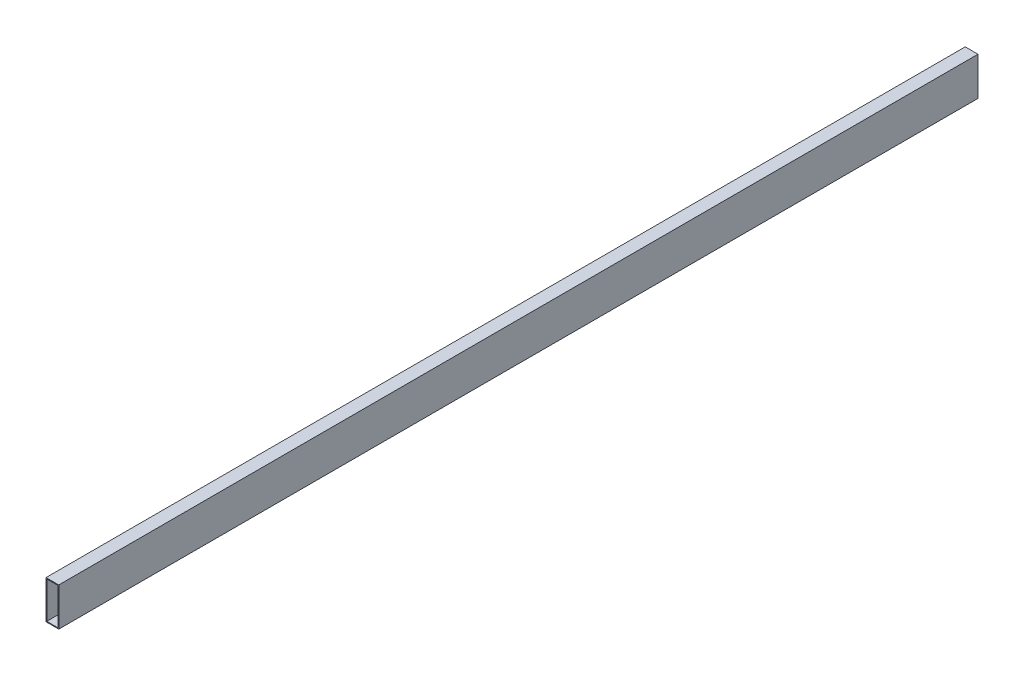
from build123d import *

# Parameters (mm, degrees)
SKETCH1_W           = 50.8
SKETCH1_H           = 152.4
SKETCH1_W_2         = 44.45
SKETCH1_H_2         = 146.05
BOSS_EXTRUDE1_DEPTH = 3657.6


with BuildPart() as part:
    # Sketch1 → Boss-Extrude1 (new body)
    with BuildSketch(Plane.XY.offset(3657.6)):
        with Locations((25.4, 76.2)):
            Rectangle(SKETCH1_W, SKETCH1_H)
        with Locations((25.4, 76.2)):
            Rectangle(SKETCH1_W_2, SKETCH1_H_2, mode=Mode.SUBTRACT)
    extrude(amount=-BOSS_EXTRUDE1_DEPTH)


solid = part.part
